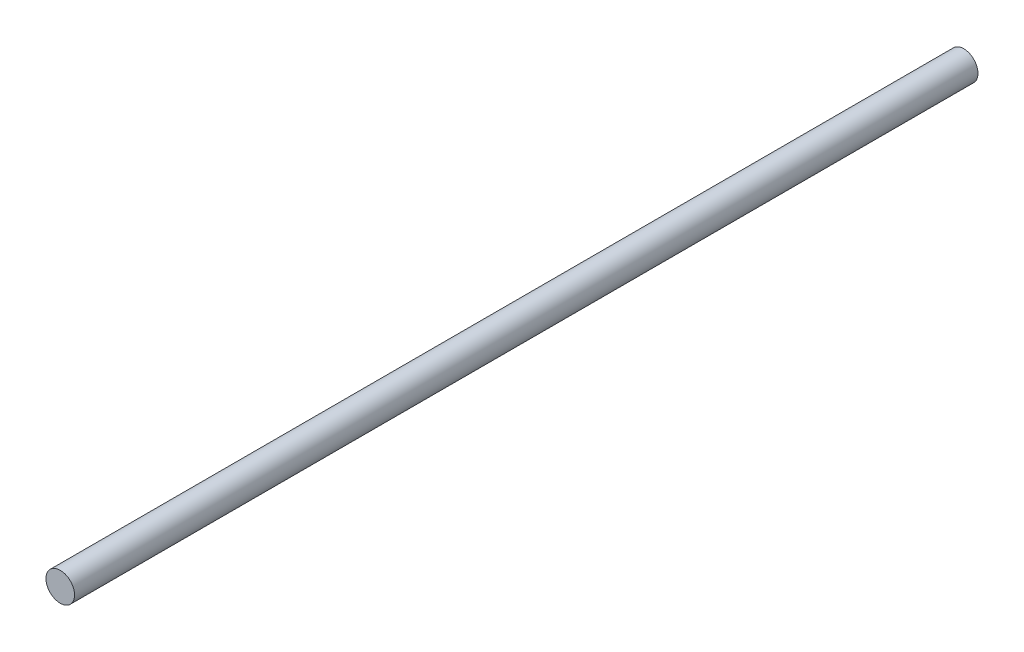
ISO-10303-21;
HEADER;
FILE_DESCRIPTION(('STEP AP214'),'2;1');
FILE_NAME('part.step','',(''),(''),'','','');
FILE_SCHEMA(('AUTOMOTIVE_DESIGN { 1 0 10303 214 1 1 1 1 }'));
ENDSEC;
DATA;
#1=APPLICATION_CONTEXT('core data for automotive mechanical design processes');
#2=APPLICATION_PROTOCOL_DEFINITION('international standard','automotive_design',2000,#1);
#3=PRODUCT_CONTEXT('',#1,'mechanical');
#4=PRODUCT('Part','Part','',(#3));
#5=PRODUCT_RELATED_PRODUCT_CATEGORY('part','',(#4));
#6=PRODUCT_DEFINITION_FORMATION('','',#4);
#7=PRODUCT_DEFINITION_CONTEXT('part definition',#1,'design');
#8=PRODUCT_DEFINITION('design','',#6,#7);
#9=PRODUCT_DEFINITION_SHAPE('','',#8);
#10=(LENGTH_UNIT() NAMED_UNIT(*) SI_UNIT(.MILLI.,.METRE.));
#11=(NAMED_UNIT(*) PLANE_ANGLE_UNIT() SI_UNIT($,.RADIAN.));
#12=(NAMED_UNIT(*) SI_UNIT($,.STERADIAN.) SOLID_ANGLE_UNIT());
#13=UNCERTAINTY_MEASURE_WITH_UNIT(LENGTH_MEASURE(1.E-05),#10,'distance_accuracy_value','');
#14=(GEOMETRIC_REPRESENTATION_CONTEXT(3) GLOBAL_UNCERTAINTY_ASSIGNED_CONTEXT((#13)) GLOBAL_UNIT_ASSIGNED_CONTEXT((#10,
#11,#12)) REPRESENTATION_CONTEXT('',''));
#15=CARTESIAN_POINT('',(0.,0.,0.));
#16=DIRECTION('',(0.,0.,1.));
#17=DIRECTION('',(1.,0.,0.));
#18=AXIS2_PLACEMENT_3D('',#15,#16,#17);
#19=CARTESIAN_POINT('',(0.,0.,401.574));
#20=DIRECTION('',(0.,0.,-1.));
#21=DIRECTION('',(-1.,0.,0.));
#22=AXIS2_PLACEMENT_3D('',#19,#20,#21);
#23=CYLINDRICAL_SURFACE('',#22,6.35);
#24=CARTESIAN_POINT('',(0.,0.,401.574));
#25=DIRECTION('',(0.,0.,1.));
#26=DIRECTION('',(1.,0.,0.));
#27=AXIS2_PLACEMENT_3D('',#24,#25,#26);
#28=CIRCLE('',#27,6.35);
#29=CARTESIAN_POINT('',(6.35,0.,401.574));
#30=VERTEX_POINT('',#29);
#31=EDGE_CURVE('E10',#30,#30,#28,.T.);
#32=ORIENTED_EDGE('',*,*,#31,.F.);
#33=EDGE_LOOP('',(#32));
#34=FACE_BOUND('',#33,.T.);
#35=CARTESIAN_POINT('',(0.,0.,0.));
#36=DIRECTION('',(0.,0.,1.));
#37=DIRECTION('',(1.,0.,0.));
#38=AXIS2_PLACEMENT_3D('',#35,#36,#37);
#39=CIRCLE('',#38,6.35);
#40=CARTESIAN_POINT('',(6.35,0.,0.));
#41=VERTEX_POINT('',#40);
#42=EDGE_CURVE('E37',#41,#41,#39,.T.);
#43=ORIENTED_EDGE('',*,*,#42,.T.);
#44=EDGE_LOOP('',(#43));
#45=FACE_BOUND('',#44,.T.);
#46=ADVANCED_FACE('F34',(#34,#45),#23,.T.);
#47=CARTESIAN_POINT('',(0.,0.,401.574));
#48=DIRECTION('',(0.,0.,1.));
#49=DIRECTION('',(1.,0.,0.));
#50=AXIS2_PLACEMENT_3D('',#47,#48,#49);
#51=PLANE('',#50);
#52=ORIENTED_EDGE('',*,*,#31,.T.);
#53=EDGE_LOOP('',(#52));
#54=FACE_BOUND('',#53,.T.);
#55=ADVANCED_FACE('F49',(#54),#51,.T.);
#56=CARTESIAN_POINT('',(0.,0.,0.));
#57=DIRECTION('',(0.,0.,1.));
#58=DIRECTION('',(1.,0.,0.));
#59=AXIS2_PLACEMENT_3D('',#56,#57,#58);
#60=PLANE('',#59);
#61=ORIENTED_EDGE('',*,*,#42,.F.);
#62=EDGE_LOOP('',(#61));
#63=FACE_BOUND('',#62,.T.);
#64=ADVANCED_FACE('F47',(#63),#60,.F.);
#65=CLOSED_SHELL('',(#46,#55,#64));
#66=MANIFOLD_SOLID_BREP('B2',#65);
#67=ADVANCED_BREP_SHAPE_REPRESENTATION('',(#18,#66),#14);
#68=SHAPE_DEFINITION_REPRESENTATION(#9,#67);
ENDSEC;
END-ISO-10303-21;
